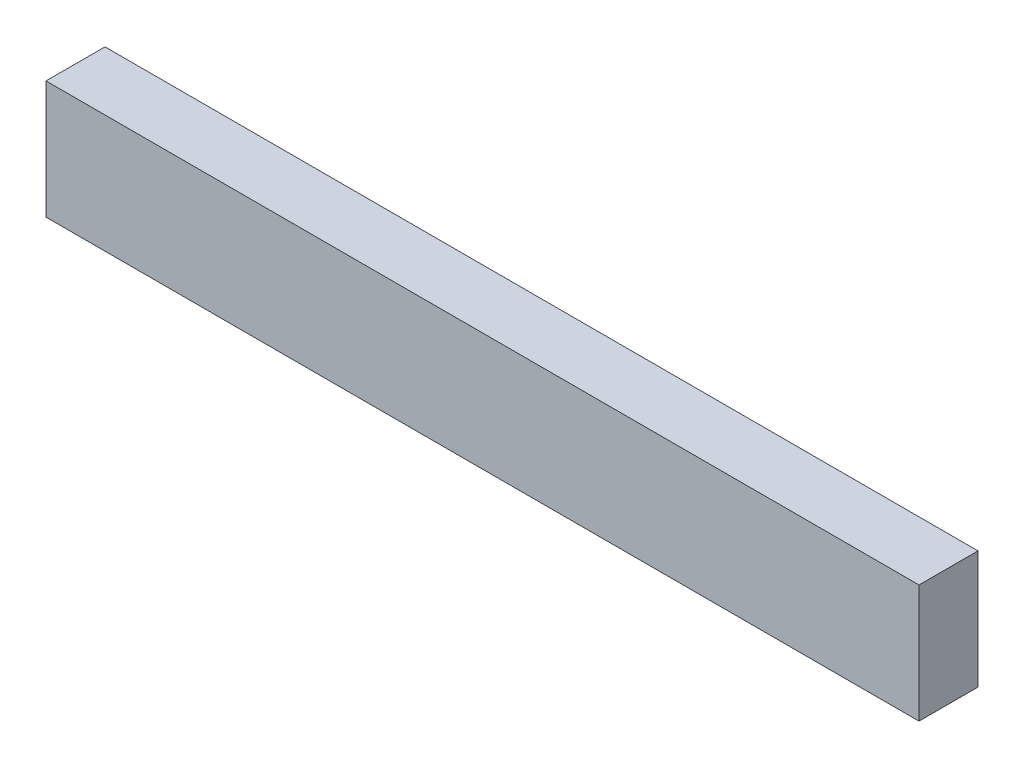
from build123d import *

# Parameters (mm, degrees)
SKETCH1_W           = 370
SKETCH1_H           = 50
BOSS_EXTRUDE1_DEPTH = 25


with BuildPart() as part:
    # Sketch1 → Boss-Extrude1 (new body)
    with BuildSketch(Plane.XY):
        Rectangle(SKETCH1_W, SKETCH1_H)
    extrude(amount=BOSS_EXTRUDE1_DEPTH)


solid = part.part
